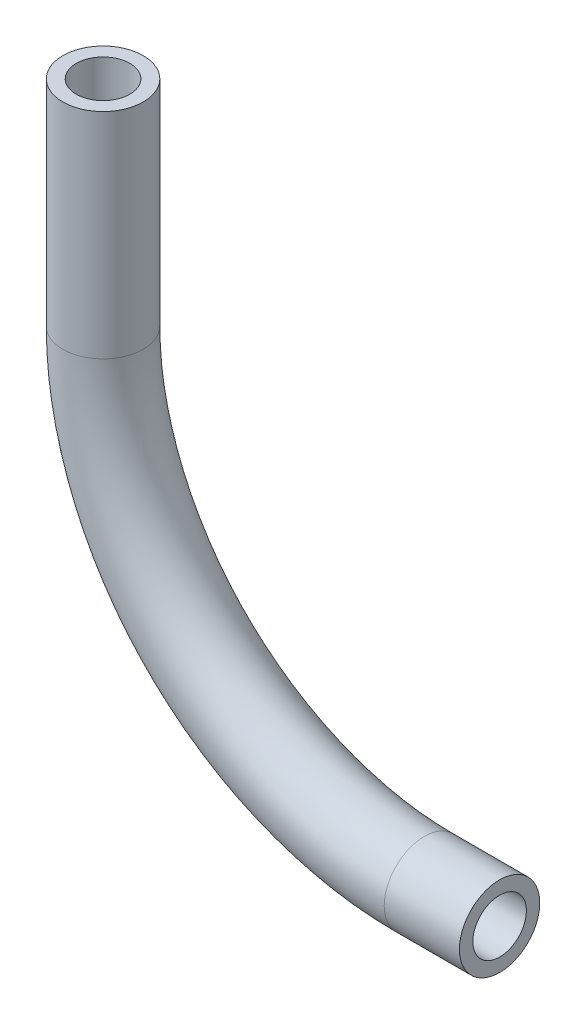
from build123d import *

# Parameters (mm, degrees)
SKETCH2_R               = 9.525
SKETCH2_R_2             = 6.35
CUT_EXTRUDE2_DEPTH      = 241.743141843
CUT_EXTRUDE2_DEPTH_BACK = 241.743141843
SKETCH5_W               = 676.382607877
SKETCH5_H               = 187.296325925


with BuildPart() as part:
    # Sweep1: sweep along a path in Sketch1
    with BuildLine(Plane.XY) as sweep1_path:
        Line((-94.040768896, 0), (-94.040768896, -50.8))
        ThreePointArc((-94.040768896, -50.8), (-71.722305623, -104.681536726), (-17.840768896, -127))
        Line((-17.840768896, -127), (112.334231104, -127))
        ThreePointArc((112.334231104, -127), (166.21576783, -104.681536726), (188.534231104, -50.8))
        Line((188.534231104, -50.8), (188.534231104, 0))
    # Sketch2 → Sweep1 (sweep)
    with BuildSketch(Plane(origin=(0, 0, 0), x_dir=(1, 0, 0), z_dir=(0, 1, 0))):
        with Locations((-94.040768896, 0)):
            Circle(SKETCH2_R)
        with Locations((-94.040768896, 0)):
            Circle(SKETCH2_R_2, mode=Mode.SUBTRACT)
    sweep(path=sweep1_path.line)

    # Sketch5 → Cut-Extrude2 (cut, two sides: drawn at the far end of the back side and taken through both)
    with BuildSketch(Plane.XY.offset(-CUT_EXTRUDE2_DEPTH_BACK)):
        with Locations((338.191303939, -68.645780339)):
            Rectangle(SKETCH5_W, SKETCH5_H)
    extrude(amount=CUT_EXTRUDE2_DEPTH + CUT_EXTRUDE2_DEPTH_BACK, mode=Mode.SUBTRACT)


solid = part.part
